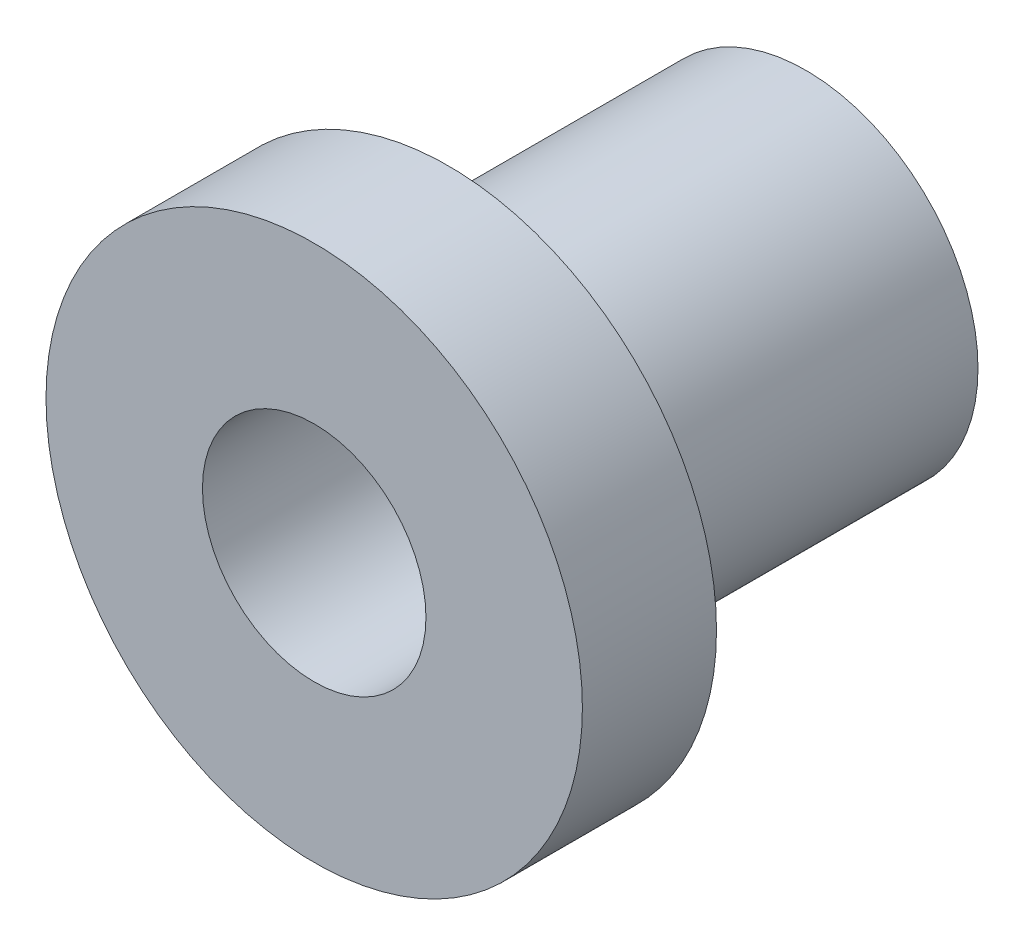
ISO-10303-21;
HEADER;
FILE_DESCRIPTION(('STEP AP214'),'2;1');
FILE_NAME('part.step','',(''),(''),'','','');
FILE_SCHEMA(('AUTOMOTIVE_DESIGN { 1 0 10303 214 1 1 1 1 }'));
ENDSEC;
DATA;
#1=APPLICATION_CONTEXT('core data for automotive mechanical design processes');
#2=APPLICATION_PROTOCOL_DEFINITION('international standard','automotive_design',2000,#1);
#3=PRODUCT_CONTEXT('',#1,'mechanical');
#4=PRODUCT('Part','Part','',(#3));
#5=PRODUCT_RELATED_PRODUCT_CATEGORY('part','',(#4));
#6=PRODUCT_DEFINITION_FORMATION('','',#4);
#7=PRODUCT_DEFINITION_CONTEXT('part definition',#1,'design');
#8=PRODUCT_DEFINITION('design','',#6,#7);
#9=PRODUCT_DEFINITION_SHAPE('','',#8);
#10=(LENGTH_UNIT() NAMED_UNIT(*) SI_UNIT(.MILLI.,.METRE.));
#11=(NAMED_UNIT(*) PLANE_ANGLE_UNIT() SI_UNIT($,.RADIAN.));
#12=(NAMED_UNIT(*) SI_UNIT($,.STERADIAN.) SOLID_ANGLE_UNIT());
#13=UNCERTAINTY_MEASURE_WITH_UNIT(LENGTH_MEASURE(1.E-05),#10,'distance_accuracy_value','');
#14=(GEOMETRIC_REPRESENTATION_CONTEXT(3) GLOBAL_UNCERTAINTY_ASSIGNED_CONTEXT((#13)) GLOBAL_UNIT_ASSIGNED_CONTEXT((#10,
#11,#12)) REPRESENTATION_CONTEXT('',''));
#15=CARTESIAN_POINT('',(0.,0.,0.));
#16=DIRECTION('',(0.,0.,1.));
#17=DIRECTION('',(1.,0.,0.));
#18=AXIS2_PLACEMENT_3D('',#15,#16,#17);
#19=CARTESIAN_POINT('',(0.,0.,8.));
#20=DIRECTION('',(0.,0.,-1.));
#21=DIRECTION('',(-1.,0.,0.));
#22=AXIS2_PLACEMENT_3D('',#19,#20,#21);
#23=CYLINDRICAL_SURFACE('',#22,3.85);
#24=CARTESIAN_POINT('',(0.,0.,8.));
#25=DIRECTION('',(0.,0.,1.));
#26=DIRECTION('',(1.,0.,0.));
#27=AXIS2_PLACEMENT_3D('',#24,#25,#26);
#28=CIRCLE('',#27,3.85);
#29=CARTESIAN_POINT('',(3.85,0.,8.));
#30=VERTEX_POINT('',#29);
#31=EDGE_CURVE('E10',#30,#30,#28,.T.);
#32=ORIENTED_EDGE('',*,*,#31,.F.);
#33=EDGE_LOOP('',(#32));
#34=FACE_BOUND('',#33,.T.);
#35=CARTESIAN_POINT('',(0.,0.,0.));
#36=DIRECTION('',(0.,0.,1.));
#37=DIRECTION('',(1.,0.,0.));
#38=AXIS2_PLACEMENT_3D('',#35,#36,#37);
#39=CIRCLE('',#38,3.85);
#40=CARTESIAN_POINT('',(3.85,0.,0.));
#41=VERTEX_POINT('',#40);
#42=EDGE_CURVE('E42',#41,#41,#39,.T.);
#43=ORIENTED_EDGE('',*,*,#42,.T.);
#44=EDGE_LOOP('',(#43));
#45=FACE_BOUND('',#44,.T.);
#46=ADVANCED_FACE('F35',(#34,#45),#23,.T.);
#47=CARTESIAN_POINT('',(0.,0.,0.));
#48=DIRECTION('',(0.,0.,1.));
#49=DIRECTION('',(1.,0.,0.));
#50=AXIS2_PLACEMENT_3D('',#47,#48,#49);
#51=PLANE('',#50);
#52=CARTESIAN_POINT('',(0.,0.,0.));
#53=DIRECTION('',(0.,0.,-1.));
#54=DIRECTION('',(-1.,0.,0.));
#55=AXIS2_PLACEMENT_3D('',#52,#53,#54);
#56=CIRCLE('',#55,2.5);
#57=CARTESIAN_POINT('',(-2.5,0.,0.));
#58=VERTEX_POINT('',#57);
#59=EDGE_CURVE('E54',#58,#58,#56,.T.);
#60=ORIENTED_EDGE('',*,*,#59,.F.);
#61=EDGE_LOOP('',(#60));
#62=FACE_BOUND('',#61,.T.);
#63=ORIENTED_EDGE('',*,*,#42,.F.);
#64=EDGE_LOOP('',(#63));
#65=FACE_BOUND('',#64,.T.);
#66=ADVANCED_FACE('F73',(#62,#65),#51,.F.);
#67=CARTESIAN_POINT('',(0.,0.,11.));
#68=DIRECTION('',(0.,0.,-1.));
#69=DIRECTION('',(-1.,0.,0.));
#70=AXIS2_PLACEMENT_3D('',#67,#68,#69);
#71=CYLINDRICAL_SURFACE('',#70,6.);
#72=CARTESIAN_POINT('',(0.,0.,11.));
#73=DIRECTION('',(0.,0.,1.));
#74=DIRECTION('',(1.,0.,0.));
#75=AXIS2_PLACEMENT_3D('',#72,#73,#74);
#76=CIRCLE('',#75,6.);
#77=CARTESIAN_POINT('',(6.,0.,11.));
#78=VERTEX_POINT('',#77);
#79=EDGE_CURVE('E47',#78,#78,#76,.T.);
#80=ORIENTED_EDGE('',*,*,#79,.F.);
#81=EDGE_LOOP('',(#80));
#82=FACE_BOUND('',#81,.T.);
#83=CARTESIAN_POINT('',(0.,0.,8.));
#84=DIRECTION('',(0.,0.,1.));
#85=DIRECTION('',(1.,0.,0.));
#86=AXIS2_PLACEMENT_3D('',#83,#84,#85);
#87=CIRCLE('',#86,6.);
#88=CARTESIAN_POINT('',(6.,0.,8.));
#89=VERTEX_POINT('',#88);
#90=EDGE_CURVE('E49',#89,#89,#87,.T.);
#91=ORIENTED_EDGE('',*,*,#90,.T.);
#92=EDGE_LOOP('',(#91));
#93=FACE_BOUND('',#92,.T.);
#94=ADVANCED_FACE('F67',(#82,#93),#71,.T.);
#95=CARTESIAN_POINT('',(0.,0.,11.));
#96=DIRECTION('',(0.,0.,1.));
#97=DIRECTION('',(1.,0.,0.));
#98=AXIS2_PLACEMENT_3D('',#95,#96,#97);
#99=PLANE('',#98);
#100=CARTESIAN_POINT('',(0.,0.,11.));
#101=DIRECTION('',(0.,0.,1.));
#102=DIRECTION('',(1.,0.,0.));
#103=AXIS2_PLACEMENT_3D('',#100,#101,#102);
#104=CIRCLE('',#103,2.5);
#105=CARTESIAN_POINT('',(2.5,0.,11.));
#106=VERTEX_POINT('',#105);
#107=EDGE_CURVE('E38',#106,#106,#104,.T.);
#108=ORIENTED_EDGE('',*,*,#107,.F.);
#109=EDGE_LOOP('',(#108));
#110=FACE_BOUND('',#109,.T.);
#111=ORIENTED_EDGE('',*,*,#79,.T.);
#112=EDGE_LOOP('',(#111));
#113=FACE_BOUND('',#112,.T.);
#114=ADVANCED_FACE('F63',(#110,#113),#99,.T.);
#115=CARTESIAN_POINT('',(0.,0.,8.));
#116=DIRECTION('',(0.,0.,1.));
#117=DIRECTION('',(1.,0.,0.));
#118=AXIS2_PLACEMENT_3D('',#115,#116,#117);
#119=PLANE('',#118);
#120=ORIENTED_EDGE('',*,*,#31,.T.);
#121=EDGE_LOOP('',(#120));
#122=FACE_BOUND('',#121,.T.);
#123=ORIENTED_EDGE('',*,*,#90,.F.);
#124=EDGE_LOOP('',(#123));
#125=FACE_BOUND('',#124,.T.);
#126=ADVANCED_FACE('F66',(#122,#125),#119,.F.);
#127=CARTESIAN_POINT('',(0.,0.,12.));
#128=DIRECTION('',(0.,0.,-1.));
#129=DIRECTION('',(-1.,0.,0.));
#130=AXIS2_PLACEMENT_3D('',#127,#128,#129);
#131=CYLINDRICAL_SURFACE('',#130,2.5);
#132=ORIENTED_EDGE('',*,*,#107,.T.);
#133=EDGE_LOOP('',(#132));
#134=FACE_BOUND('',#133,.T.);
#135=ORIENTED_EDGE('',*,*,#59,.T.);
#136=EDGE_LOOP('',(#135));
#137=FACE_BOUND('',#136,.T.);
#138=ADVANCED_FACE('F61',(#134,#137),#131,.F.);
#139=CLOSED_SHELL('',(#46,#66,#94,#114,#126,#138));
#140=MANIFOLD_SOLID_BREP('B2',#139);
#141=ADVANCED_BREP_SHAPE_REPRESENTATION('',(#18,#140),#14);
#142=SHAPE_DEFINITION_REPRESENTATION(#9,#141);
ENDSEC;
END-ISO-10303-21;
